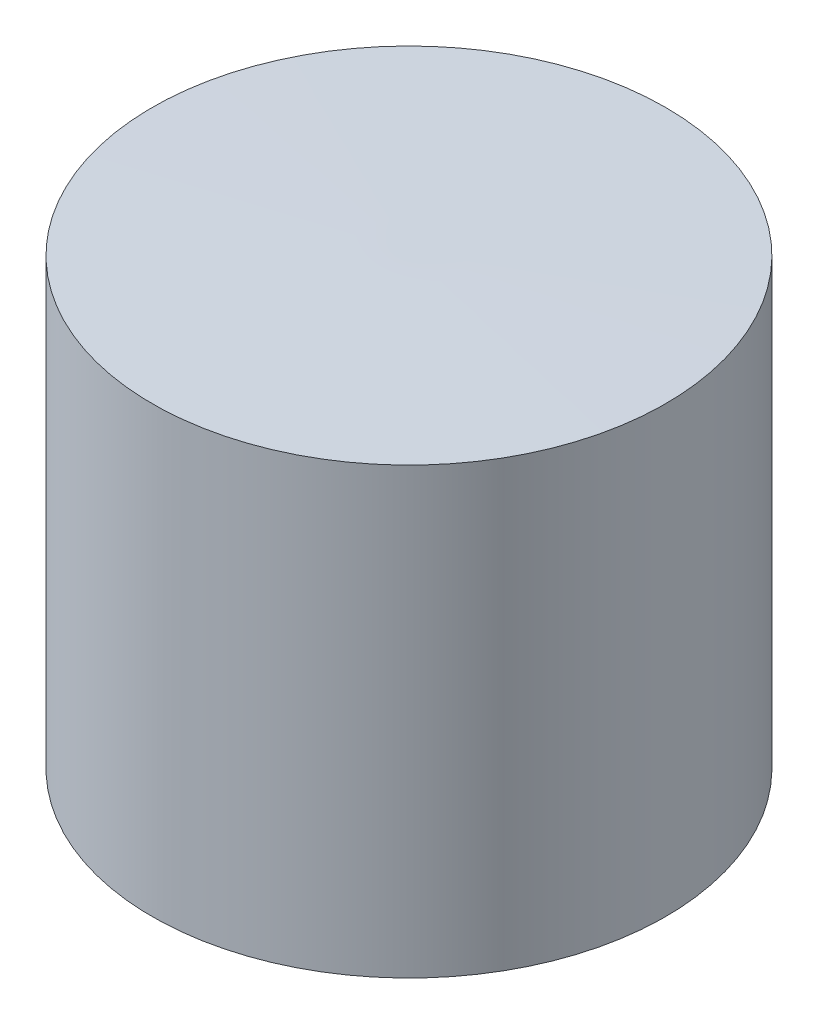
from build123d import *


with BuildPart() as part:
    # Sketch1 → Revolve1 (revolve)
    with BuildSketch(Plane.XY, mode=Mode.PRIVATE) as revolve1_sk:
        Polygon((0, 0), (0, 90.8812), (52.07, 90.123883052), (52.07, 0), align=None)
    revolve(revolve1_sk.sketch.rotate(Axis((0, 0, 0), (0, 1, 0)), 90), axis=Axis((0, 0, 0), (0, 1, 0)))


solid = part.part
